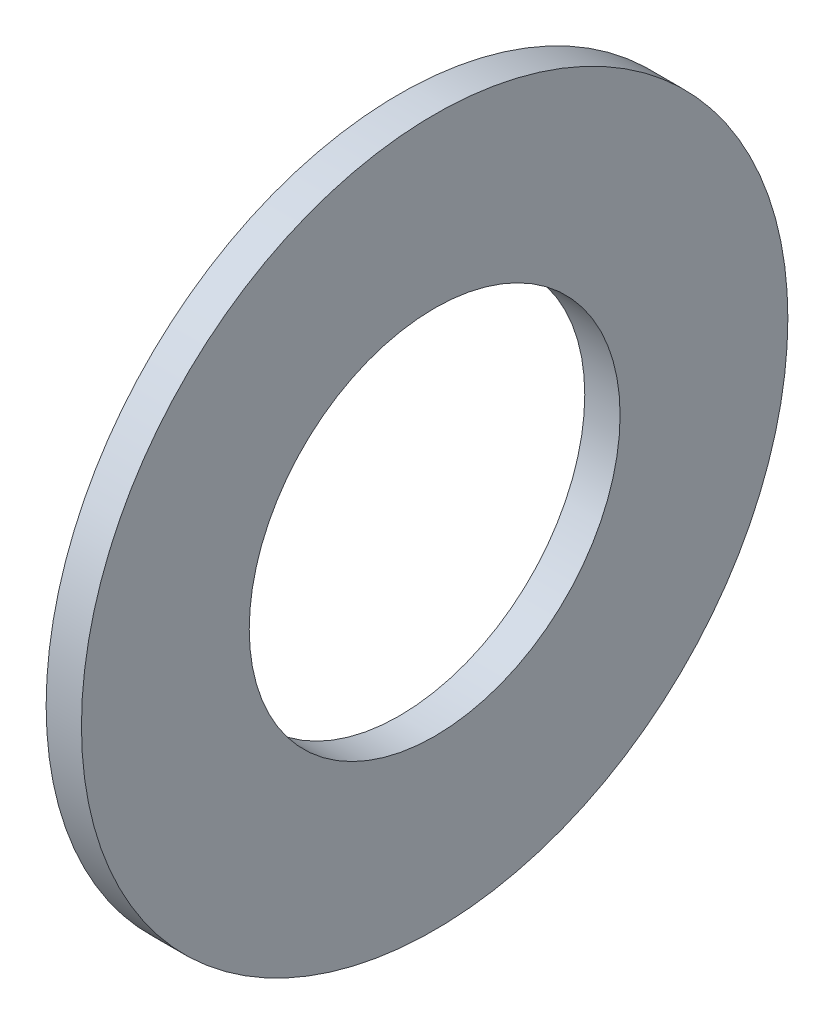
from build123d import *

# Parameters (mm, degrees)
ESQUISSE1_W = 1
ESQUISSE1_H = 4.75


with BuildPart() as part:
    # Esquisse1 → Base-R_volution (revolve)
    with BuildSketch(Plane(origin=(0, 0, 0), x_dir=(1, 0, 0), z_dir=(0, 1, 0)), mode=Mode.PRIVATE) as base_r_volution_sk:
        with Locations((0.5, 7.625)):
            Rectangle(ESQUISSE1_W, ESQUISSE1_H)
    revolve(base_r_volution_sk.sketch.rotate(Axis((0, 0, 0), (1, 0, 0)), 180), axis=Axis((0, 0, 0), (1, 0, 0)))


solid = part.part
